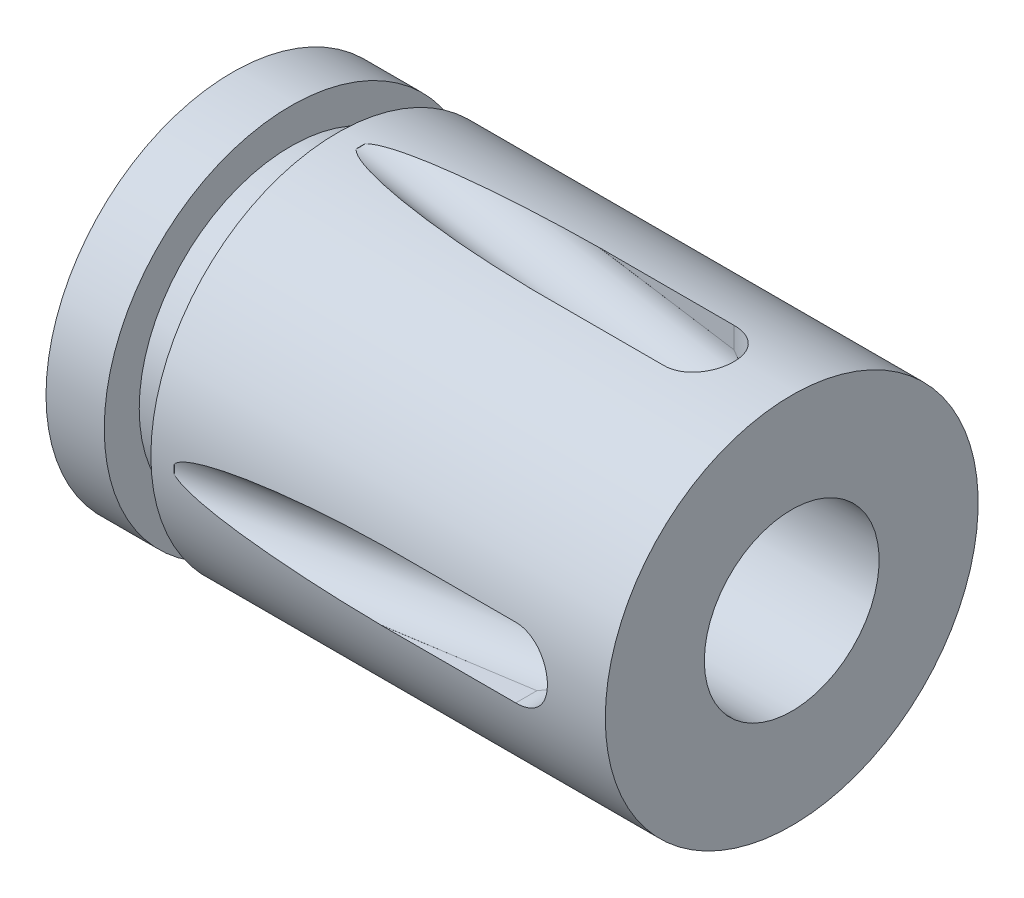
from build123d import *

# Parameters (mm, degrees)
ENL_V_MAT_EXTRU_1_DEPTH      = 1.5
R_P_TITION_CIRCULAIRE1_COUNT = 4


with BuildPart() as part:
    # Esquisse1 → R_volution1 (revolve)
    with BuildSketch(Plane.XY, mode=Mode.PRIVATE) as r_volution1_sk:
        Polygon((0, 5.75), (0, 8), (2.5, 8), (2.5, 6.5), (4.5, 6.5), (4.5, 8), (24, 8), (24, 3.75), (2, 3.75), align=None)
    revolve(r_volution1_sk.sketch.rotate(Axis((-20.042792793, 0, 0), (1, 0, 0)), 90), axis=Axis((-20.042792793, 0, 0), (1, 0, 0)))

    # Enl_vement de mati_re-Balayage5: sweep along a path in Esquisse2
    with BuildLine(Plane.XY) as enl_vement_de_mati_re_balayage5_path:
        Line((21.5, 12.154420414), (21.5, 5.178768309))
        Line((21.5, 5.178768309), (5.5, 8))
    # Esquisse4 → Enl_vement de mati_re-Balayage5 (sweep, cut)
    with BuildSketch(Plane(origin=(5.5, 8, 0), x_dir=(0, 0, 1), z_dir=(-0.9848077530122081, 0.17364817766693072, 0))):
        with BuildLine():
            Line((-1.5, 1.485329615), (1.5, 1.485329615))
            ThreePointArc((1.5, 1.485329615), (0, -0.014670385), (-1.5, 1.485329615))
        make_face()
    enl_vement_de_mati_re_balayage5 = sweep(path=enl_vement_de_mati_re_balayage5_path.line, transition=Transition.RIGHT, mode=Mode.SUBTRACT)

    # Esquisse5 → Enl_v. mat.-Extru.1 (cut, symmetric)
    with BuildSketch(Plane.XY):
        Polygon((20.014670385, 6.948915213), (20.014670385, 9.348544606), (12.382619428, 8.14872991), align=None)
    enl_v_mat_extru_1 = extrude(amount=ENL_V_MAT_EXTRU_1_DEPTH, both=True, mode=Mode.SUBTRACT)

    # R_p_tition circulaire1: Enl_vement de mati_re-Balayage5, Enl_v. mat.-Extru.1 ×4 about axis
    r_p_tition_circulaire1_axis = Axis((0, 0, 0), (1, 0, 0))
    add([enl_vement_de_mati_re_balayage5.rotate(r_p_tition_circulaire1_axis, i * 360 / R_P_TITION_CIRCULAIRE1_COUNT) for i in range(1, R_P_TITION_CIRCULAIRE1_COUNT)], mode=Mode.SUBTRACT)
    add([enl_v_mat_extru_1.rotate(r_p_tition_circulaire1_axis, i * 360 / R_P_TITION_CIRCULAIRE1_COUNT) for i in range(1, R_P_TITION_CIRCULAIRE1_COUNT)], mode=Mode.SUBTRACT)


solid = part.part
